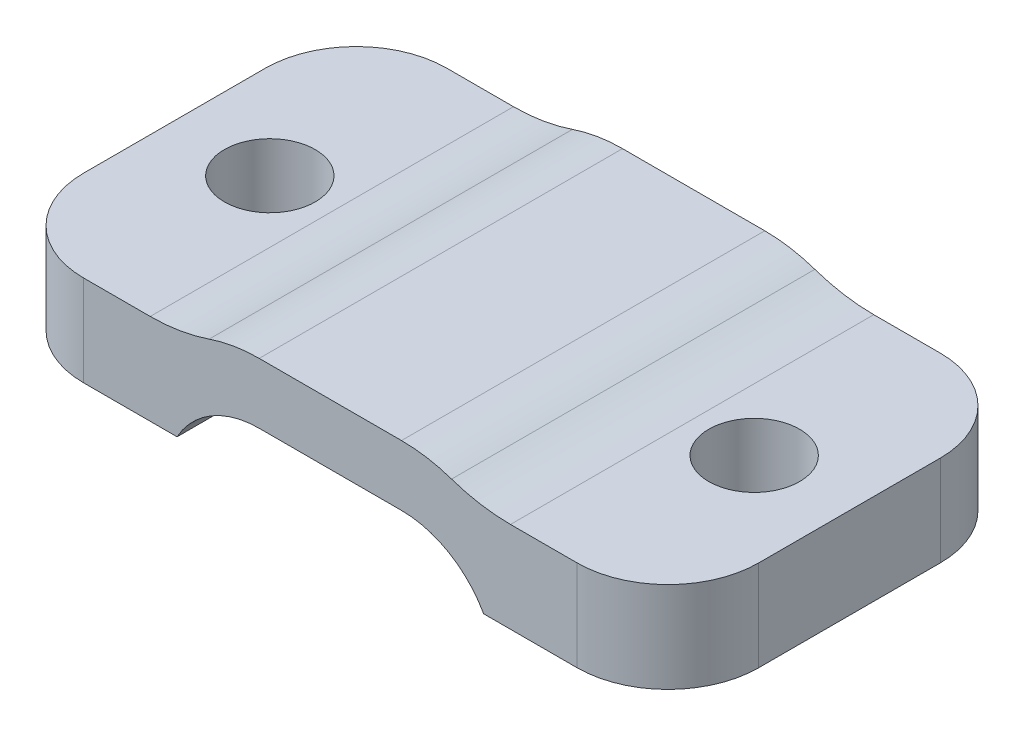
ISO-10303-21;
HEADER;
FILE_DESCRIPTION(('STEP AP214'),'2;1');
FILE_NAME('part.step','',(''),(''),'','','');
FILE_SCHEMA(('AUTOMOTIVE_DESIGN { 1 0 10303 214 1 1 1 1 }'));
ENDSEC;
DATA;
#1=APPLICATION_CONTEXT('core data for automotive mechanical design processes');
#2=APPLICATION_PROTOCOL_DEFINITION('international standard','automotive_design',2000,#1);
#3=PRODUCT_CONTEXT('',#1,'mechanical');
#4=PRODUCT('Part','Part','',(#3));
#5=PRODUCT_RELATED_PRODUCT_CATEGORY('part','',(#4));
#6=PRODUCT_DEFINITION_FORMATION('','',#4);
#7=PRODUCT_DEFINITION_CONTEXT('part definition',#1,'design');
#8=PRODUCT_DEFINITION('design','',#6,#7);
#9=PRODUCT_DEFINITION_SHAPE('','',#8);
#10=(LENGTH_UNIT() NAMED_UNIT(*) SI_UNIT(.MILLI.,.METRE.));
#11=(NAMED_UNIT(*) PLANE_ANGLE_UNIT() SI_UNIT($,.RADIAN.));
#12=(NAMED_UNIT(*) SI_UNIT($,.STERADIAN.) SOLID_ANGLE_UNIT());
#13=UNCERTAINTY_MEASURE_WITH_UNIT(LENGTH_MEASURE(1.E-05),#10,'distance_accuracy_value','');
#14=(GEOMETRIC_REPRESENTATION_CONTEXT(3) GLOBAL_UNCERTAINTY_ASSIGNED_CONTEXT((#13)) GLOBAL_UNIT_ASSIGNED_CONTEXT((#10,
#11,#12)) REPRESENTATION_CONTEXT('',''));
#15=CARTESIAN_POINT('',(0.,0.,0.));
#16=DIRECTION('',(0.,0.,1.));
#17=DIRECTION('',(1.,0.,0.));
#18=AXIS2_PLACEMENT_3D('',#15,#16,#17);
#19=CARTESIAN_POINT('',(0.,1.5,12.));
#20=DIRECTION('',(0.,1.,0.));
#21=DIRECTION('',(0.,0.,1.));
#22=AXIS2_PLACEMENT_3D('',#19,#20,#21);
#23=PLANE('',#22);
#24=CARTESIAN_POINT('',(-5.65,1.5,6.));
#25=DIRECTION('',(0.,1.,0.));
#26=DIRECTION('',(0.,0.,1.));
#27=AXIS2_PLACEMENT_3D('',#24,#25,#26);
#28=CIRCLE('',#27,1.5);
#29=CARTESIAN_POINT('',(-5.65,1.5,7.5));
#30=VERTEX_POINT('',#29);
#31=EDGE_CURVE('E274',#30,#30,#28,.T.);
#32=ORIENTED_EDGE('',*,*,#31,.T.);
#33=EDGE_LOOP('',(#32));
#34=FACE_BOUND('',#33,.T.);
#35=DIRECTION('',(0.,0.,-1.));
#36=VECTOR('',#35,1.);
#37=CARTESIAN_POINT('',(-8.8,1.5,12.));
#38=LINE('',#37,#36);
#39=CARTESIAN_POINT('',(-8.8,1.5,9.));
#40=VERTEX_POINT('',#39);
#41=CARTESIAN_POINT('',(-8.8,1.5,3.));
#42=VERTEX_POINT('',#41);
#43=EDGE_CURVE('E208',#40,#42,#38,.T.);
#44=ORIENTED_EDGE('',*,*,#43,.T.);
#45=CARTESIAN_POINT('',(-5.8,1.5,3.));
#46=DIRECTION('',(0.,1.,0.));
#47=DIRECTION('',(0.,0.,1.));
#48=AXIS2_PLACEMENT_3D('',#45,#46,#47);
#49=CIRCLE('',#48,3.);
#50=CARTESIAN_POINT('',(-5.8,1.5,0.));
#51=VERTEX_POINT('',#50);
#52=EDGE_CURVE('E283',#42,#51,#49,.F.);
#53=ORIENTED_EDGE('',*,*,#52,.T.);
#54=DIRECTION('',(1.,0.,0.));
#55=VECTOR('',#54,1.);
#56=CARTESIAN_POINT('',(0.,1.5,0.));
#57=LINE('',#56,#55);
#58=CARTESIAN_POINT('',(-2.71293199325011,1.5,0.));
#59=VERTEX_POINT('',#58);
#60=EDGE_CURVE('E177',#51,#59,#57,.T.);
#61=ORIENTED_EDGE('',*,*,#60,.T.);
#62=DIRECTION('',(0.,0.,-1.));
#63=VECTOR('',#62,1.);
#64=CARTESIAN_POINT('',(-2.71293199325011,1.5,12.));
#65=LINE('',#64,#63);
#66=CARTESIAN_POINT('',(-2.71293199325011,1.5,12.));
#67=VERTEX_POINT('',#66);
#68=EDGE_CURVE('E174',#67,#59,#65,.T.);
#69=ORIENTED_EDGE('',*,*,#68,.F.);
#70=DIRECTION('',(1.,0.,0.));
#71=VECTOR('',#70,1.);
#72=CARTESIAN_POINT('',(0.,1.5,12.));
#73=LINE('',#72,#71);
#74=CARTESIAN_POINT('',(-5.8,1.5,12.));
#75=VERTEX_POINT('',#74);
#76=EDGE_CURVE('E163',#75,#67,#73,.T.);
#77=ORIENTED_EDGE('',*,*,#76,.F.);
#78=CARTESIAN_POINT('',(-5.8,1.5,9.));
#79=DIRECTION('',(0.,1.,0.));
#80=DIRECTION('',(0.,0.,1.));
#81=AXIS2_PLACEMENT_3D('',#78,#79,#80);
#82=CIRCLE('',#81,3.);
#83=EDGE_CURVE('E281',#75,#40,#82,.F.);
#84=ORIENTED_EDGE('',*,*,#83,.T.);
#85=EDGE_LOOP('',(#44,#53,#61,#69,#77,#84));
#86=FACE_BOUND('',#85,.T.);
#87=ADVANCED_FACE('F36',(#34,#86),#23,.F.);
#88=CARTESIAN_POINT('',(0.,0.,12.));
#89=DIRECTION('',(0.,0.,-1.));
#90=DIRECTION('',(-1.,0.,0.));
#91=AXIS2_PLACEMENT_3D('',#88,#89,#90);
#92=CYLINDRICAL_SURFACE('',#91,3.1);
#93=CARTESIAN_POINT('',(0.,0.,0.));
#94=DIRECTION('',(0.,0.,1.));
#95=DIRECTION('',(1.,0.,0.));
#96=AXIS2_PLACEMENT_3D('',#93,#94,#95);
#97=CIRCLE('',#96,3.1);
#98=CARTESIAN_POINT('',(0.,3.1,0.));
#99=VERTEX_POINT('',#98);
#100=EDGE_CURVE('E210',#99,#59,#97,.T.);
#101=ORIENTED_EDGE('',*,*,#100,.F.);
#102=DIRECTION('',(0.,0.,-1.));
#103=VECTOR('',#102,1.);
#104=CARTESIAN_POINT('',(0.,3.1,12.));
#105=LINE('',#104,#103);
#106=CARTESIAN_POINT('',(0.,3.1,12.));
#107=VERTEX_POINT('',#106);
#108=EDGE_CURVE('E182',#107,#99,#105,.T.);
#109=ORIENTED_EDGE('',*,*,#108,.F.);
#110=CARTESIAN_POINT('',(0.,0.,12.));
#111=DIRECTION('',(0.,0.,1.));
#112=DIRECTION('',(1.,0.,0.));
#113=AXIS2_PLACEMENT_3D('',#110,#111,#112);
#114=CIRCLE('',#113,3.1);
#115=EDGE_CURVE('E167',#107,#67,#114,.T.);
#116=ORIENTED_EDGE('',*,*,#115,.T.);
#117=ORIENTED_EDGE('',*,*,#68,.T.);
#118=EDGE_LOOP('',(#101,#109,#116,#117));
#119=FACE_BOUND('',#118,.T.);
#120=ADVANCED_FACE('F184',(#119),#92,.F.);
#121=CARTESIAN_POINT('',(0.,3.1,12.));
#122=DIRECTION('',(0.,1.,0.));
#123=DIRECTION('',(0.,0.,1.));
#124=AXIS2_PLACEMENT_3D('',#121,#122,#123);
#125=PLANE('',#124);
#126=DIRECTION('',(1.,0.,0.));
#127=VECTOR('',#126,1.);
#128=CARTESIAN_POINT('',(0.,3.1,0.));
#129=LINE('',#128,#127);
#130=CARTESIAN_POINT('',(4.7,3.1,0.));
#131=VERTEX_POINT('',#130);
#132=EDGE_CURVE('E213',#99,#131,#129,.T.);
#133=ORIENTED_EDGE('',*,*,#132,.T.);
#134=DIRECTION('',(0.,0.,-1.));
#135=VECTOR('',#134,1.);
#136=CARTESIAN_POINT('',(4.7,3.1,12.));
#137=LINE('',#136,#135);
#138=CARTESIAN_POINT('',(4.7,3.1,12.));
#139=VERTEX_POINT('',#138);
#140=EDGE_CURVE('E249',#139,#131,#137,.T.);
#141=ORIENTED_EDGE('',*,*,#140,.F.);
#142=DIRECTION('',(1.,0.,0.));
#143=VECTOR('',#142,1.);
#144=CARTESIAN_POINT('',(0.,3.1,12.));
#145=LINE('',#144,#143);
#146=EDGE_CURVE('E186',#107,#139,#145,.T.);
#147=ORIENTED_EDGE('',*,*,#146,.F.);
#148=ORIENTED_EDGE('',*,*,#108,.T.);
#149=EDGE_LOOP('',(#133,#141,#147,#148));
#150=FACE_BOUND('',#149,.T.);
#151=ADVANCED_FACE('F333',(#150),#125,.F.);
#152=CARTESIAN_POINT('',(4.7,0.,12.));
#153=DIRECTION('',(0.,0.,-1.));
#154=DIRECTION('',(-1.,0.,0.));
#155=AXIS2_PLACEMENT_3D('',#152,#153,#154);
#156=CYLINDRICAL_SURFACE('',#155,3.1);
#157=CARTESIAN_POINT('',(4.7,0.,0.));
#158=DIRECTION('',(0.,0.,1.));
#159=DIRECTION('',(1.,0.,0.));
#160=AXIS2_PLACEMENT_3D('',#157,#158,#159);
#161=CIRCLE('',#160,3.1);
#162=CARTESIAN_POINT('',(7.41293199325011,1.5,0.));
#163=VERTEX_POINT('',#162);
#164=EDGE_CURVE('E216',#163,#131,#161,.T.);
#165=ORIENTED_EDGE('',*,*,#164,.F.);
#166=DIRECTION('',(0.,0.,-1.));
#167=VECTOR('',#166,1.);
#168=CARTESIAN_POINT('',(7.41293199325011,1.5,12.));
#169=LINE('',#168,#167);
#170=CARTESIAN_POINT('',(7.41293199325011,1.5,12.));
#171=VERTEX_POINT('',#170);
#172=EDGE_CURVE('E247',#171,#163,#169,.T.);
#173=ORIENTED_EDGE('',*,*,#172,.F.);
#174=CARTESIAN_POINT('',(4.7,0.,12.));
#175=DIRECTION('',(0.,0.,1.));
#176=DIRECTION('',(1.,0.,0.));
#177=AXIS2_PLACEMENT_3D('',#174,#175,#176);
#178=CIRCLE('',#177,3.1);
#179=EDGE_CURVE('E188',#171,#139,#178,.T.);
#180=ORIENTED_EDGE('',*,*,#179,.T.);
#181=ORIENTED_EDGE('',*,*,#140,.T.);
#182=EDGE_LOOP('',(#165,#173,#180,#181));
#183=FACE_BOUND('',#182,.T.);
#184=ADVANCED_FACE('F330',(#183),#156,.F.);
#185=CARTESIAN_POINT('',(0.,1.5,12.));
#186=DIRECTION('',(0.,1.,0.));
#187=DIRECTION('',(0.,0.,1.));
#188=AXIS2_PLACEMENT_3D('',#185,#186,#187);
#189=PLANE('',#188);
#190=CARTESIAN_POINT('',(10.35,1.5,6.));
#191=DIRECTION('',(0.,1.,0.));
#192=DIRECTION('',(0.,0.,1.));
#193=AXIS2_PLACEMENT_3D('',#190,#191,#192);
#194=CIRCLE('',#193,1.5);
#195=CARTESIAN_POINT('',(10.35,1.5,7.5));
#196=VERTEX_POINT('',#195);
#197=EDGE_CURVE('E423',#196,#196,#194,.T.);
#198=ORIENTED_EDGE('',*,*,#197,.T.);
#199=EDGE_LOOP('',(#198));
#200=FACE_BOUND('',#199,.T.);
#201=DIRECTION('',(1.,0.,0.));
#202=VECTOR('',#201,1.);
#203=CARTESIAN_POINT('',(0.,1.5,0.));
#204=LINE('',#203,#202);
#205=CARTESIAN_POINT('',(10.5,1.5,0.));
#206=VERTEX_POINT('',#205);
#207=EDGE_CURVE('E219',#163,#206,#204,.T.);
#208=ORIENTED_EDGE('',*,*,#207,.T.);
#209=CARTESIAN_POINT('',(10.5,1.5,3.));
#210=DIRECTION('',(0.,1.,0.));
#211=DIRECTION('',(0.,0.,1.));
#212=AXIS2_PLACEMENT_3D('',#209,#210,#211);
#213=CIRCLE('',#212,3.);
#214=CARTESIAN_POINT('',(13.5,1.5,3.));
#215=VERTEX_POINT('',#214);
#216=EDGE_CURVE('E296',#206,#215,#213,.F.);
#217=ORIENTED_EDGE('',*,*,#216,.T.);
#218=DIRECTION('',(0.,0.,-1.));
#219=VECTOR('',#218,1.);
#220=CARTESIAN_POINT('',(13.5,1.5,12.));
#221=LINE('',#220,#219);
#222=CARTESIAN_POINT('',(13.5,1.5,9.));
#223=VERTEX_POINT('',#222);
#224=EDGE_CURVE('E245',#223,#215,#221,.T.);
#225=ORIENTED_EDGE('',*,*,#224,.F.);
#226=CARTESIAN_POINT('',(10.5,1.5,9.));
#227=DIRECTION('',(0.,1.,0.));
#228=DIRECTION('',(0.,0.,1.));
#229=AXIS2_PLACEMENT_3D('',#226,#227,#228);
#230=CIRCLE('',#229,3.);
#231=CARTESIAN_POINT('',(10.5,1.5,12.));
#232=VERTEX_POINT('',#231);
#233=EDGE_CURVE('E294',#223,#232,#230,.F.);
#234=ORIENTED_EDGE('',*,*,#233,.T.);
#235=DIRECTION('',(1.,0.,0.));
#236=VECTOR('',#235,1.);
#237=CARTESIAN_POINT('',(0.,1.5,12.));
#238=LINE('',#237,#236);
#239=EDGE_CURVE('E194',#171,#232,#238,.T.);
#240=ORIENTED_EDGE('',*,*,#239,.F.);
#241=ORIENTED_EDGE('',*,*,#172,.T.);
#242=EDGE_LOOP('',(#208,#217,#225,#234,#240,#241));
#243=FACE_BOUND('',#242,.T.);
#244=ADVANCED_FACE('F319',(#200,#243),#189,.F.);
#245=CARTESIAN_POINT('',(13.5,0.,12.));
#246=DIRECTION('',(1.,0.,0.));
#247=DIRECTION('',(0.,0.,-1.));
#248=AXIS2_PLACEMENT_3D('',#245,#246,#247);
#249=PLANE('',#248);
#250=ORIENTED_EDGE('',*,*,#224,.T.);
#251=DIRECTION('',(0.,-1.,0.));
#252=VECTOR('',#251,1.);
#253=CARTESIAN_POINT('',(13.5,4.5,3.));
#254=LINE('',#253,#252);
#255=CARTESIAN_POINT('',(13.5,4.5,3.));
#256=VERTEX_POINT('',#255);
#257=EDGE_CURVE('E57',#215,#256,#254,.F.);
#258=ORIENTED_EDGE('',*,*,#257,.T.);
#259=DIRECTION('',(0.,0.,-1.));
#260=VECTOR('',#259,1.);
#261=CARTESIAN_POINT('',(13.5,4.5,12.));
#262=LINE('',#261,#260);
#263=CARTESIAN_POINT('',(13.5,4.5,9.));
#264=VERTEX_POINT('',#263);
#265=EDGE_CURVE('E243',#264,#256,#262,.T.);
#266=ORIENTED_EDGE('',*,*,#265,.F.);
#267=DIRECTION('',(0.,-1.,0.));
#268=VECTOR('',#267,1.);
#269=CARTESIAN_POINT('',(13.5,0.,9.));
#270=LINE('',#269,#268);
#271=EDGE_CURVE('E298',#264,#223,#270,.T.);
#272=ORIENTED_EDGE('',*,*,#271,.T.);
#273=EDGE_LOOP('',(#250,#258,#266,#272));
#274=FACE_BOUND('',#273,.T.);
#275=ADVANCED_FACE('F320',(#274),#249,.T.);
#276=CARTESIAN_POINT('',(0.,4.5,12.));
#277=DIRECTION('',(0.,1.,0.));
#278=DIRECTION('',(0.,0.,1.));
#279=AXIS2_PLACEMENT_3D('',#276,#277,#278);
#280=PLANE('',#279);
#281=CARTESIAN_POINT('',(10.35,4.5,6.));
#282=DIRECTION('',(0.,1.,0.));
#283=DIRECTION('',(0.,0.,1.));
#284=AXIS2_PLACEMENT_3D('',#281,#282,#283);
#285=CIRCLE('',#284,1.5);
#286=CARTESIAN_POINT('',(10.35,4.5,7.5));
#287=VERTEX_POINT('',#286);
#288=EDGE_CURVE('E211',#287,#287,#285,.T.);
#289=ORIENTED_EDGE('',*,*,#288,.F.);
#290=EDGE_LOOP('',(#289));
#291=FACE_BOUND('',#290,.T.);
#292=ORIENTED_EDGE('',*,*,#265,.T.);
#293=CARTESIAN_POINT('',(10.5,4.5,3.));
#294=DIRECTION('',(0.,1.,0.));
#295=DIRECTION('',(0.,0.,1.));
#296=AXIS2_PLACEMENT_3D('',#293,#294,#295);
#297=CIRCLE('',#296,3.);
#298=CARTESIAN_POINT('',(10.5,4.5,0.));
#299=VERTEX_POINT('',#298);
#300=EDGE_CURVE('E304',#256,#299,#297,.T.);
#301=ORIENTED_EDGE('',*,*,#300,.T.);
#302=DIRECTION('',(1.,0.,0.));
#303=VECTOR('',#302,1.);
#304=CARTESIAN_POINT('',(0.,4.5,0.));
#305=LINE('',#304,#303);
#306=CARTESIAN_POINT('',(8.3,4.5,0.));
#307=VERTEX_POINT('',#306);
#308=EDGE_CURVE('E222',#307,#299,#305,.T.);
#309=ORIENTED_EDGE('',*,*,#308,.F.);
#310=DIRECTION('',(0.,0.,-1.));
#311=VECTOR('',#310,1.);
#312=CARTESIAN_POINT('',(8.3,4.5,12.));
#313=LINE('',#312,#311);
#314=CARTESIAN_POINT('',(8.3,4.5,12.));
#315=VERTEX_POINT('',#314);
#316=EDGE_CURVE('E254',#307,#315,#313,.F.);
#317=ORIENTED_EDGE('',*,*,#316,.T.);
#318=DIRECTION('',(1.,0.,0.));
#319=VECTOR('',#318,1.);
#320=CARTESIAN_POINT('',(0.,4.5,12.));
#321=LINE('',#320,#319);
#322=CARTESIAN_POINT('',(10.5,4.5,12.));
#323=VERTEX_POINT('',#322);
#324=EDGE_CURVE('E196',#315,#323,#321,.T.);
#325=ORIENTED_EDGE('',*,*,#324,.T.);
#326=CARTESIAN_POINT('',(10.5,4.5,9.));
#327=DIRECTION('',(0.,1.,0.));
#328=DIRECTION('',(0.,0.,1.));
#329=AXIS2_PLACEMENT_3D('',#326,#327,#328);
#330=CIRCLE('',#329,3.);
#331=EDGE_CURVE('E302',#323,#264,#330,.T.);
#332=ORIENTED_EDGE('',*,*,#331,.T.);
#333=EDGE_LOOP('',(#292,#301,#309,#317,#325,#332));
#334=FACE_BOUND('',#333,.T.);
#335=ADVANCED_FACE('F308',(#291,#334),#280,.T.);
#336=CARTESIAN_POINT('',(4.7,0.,12.));
#337=DIRECTION('',(0.,0.,-1.));
#338=DIRECTION('',(-1.,0.,0.));
#339=AXIS2_PLACEMENT_3D('',#336,#337,#338);
#340=CYLINDRICAL_SURFACE('',#339,5.1);
#341=CARTESIAN_POINT('',(4.7,0.,12.));
#342=DIRECTION('',(0.,0.,1.));
#343=DIRECTION('',(1.,0.,0.));
#344=AXIS2_PLACEMENT_3D('',#341,#342,#343);
#345=CIRCLE('',#344,5.1);
#346=CARTESIAN_POINT('',(6.35405405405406,4.82432432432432,12.));
#347=VERTEX_POINT('',#346);
#348=CARTESIAN_POINT('',(4.7,5.1,12.));
#349=VERTEX_POINT('',#348);
#350=EDGE_CURVE('E198',#347,#349,#345,.T.);
#351=ORIENTED_EDGE('',*,*,#350,.F.);
#352=DIRECTION('',(0.,0.,-1.));
#353=VECTOR('',#352,1.);
#354=CARTESIAN_POINT('',(6.35405405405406,4.82432432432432,12.));
#355=LINE('',#354,#353);
#356=CARTESIAN_POINT('',(6.35405405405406,4.82432432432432,0.));
#357=VERTEX_POINT('',#356);
#358=EDGE_CURVE('E181',#347,#357,#355,.T.);
#359=ORIENTED_EDGE('',*,*,#358,.T.);
#360=CARTESIAN_POINT('',(4.7,0.,0.));
#361=DIRECTION('',(0.,0.,1.));
#362=DIRECTION('',(1.,0.,0.));
#363=AXIS2_PLACEMENT_3D('',#360,#361,#362);
#364=CIRCLE('',#363,5.1);
#365=CARTESIAN_POINT('',(4.7,5.1,0.));
#366=VERTEX_POINT('',#365);
#367=EDGE_CURVE('E225',#357,#366,#364,.T.);
#368=ORIENTED_EDGE('',*,*,#367,.T.);
#369=DIRECTION('',(0.,0.,-1.));
#370=VECTOR('',#369,1.);
#371=CARTESIAN_POINT('',(4.7,5.1,12.));
#372=LINE('',#371,#370);
#373=EDGE_CURVE('E240',#349,#366,#372,.T.);
#374=ORIENTED_EDGE('',*,*,#373,.F.);
#375=EDGE_LOOP('',(#351,#359,#368,#374));
#376=FACE_BOUND('',#375,.T.);
#377=ADVANCED_FACE('F407',(#376),#340,.T.);
#378=CARTESIAN_POINT('',(0.,5.1,12.));
#379=DIRECTION('',(0.,1.,0.));
#380=DIRECTION('',(0.,0.,1.));
#381=AXIS2_PLACEMENT_3D('',#378,#379,#380);
#382=PLANE('',#381);
#383=DIRECTION('',(1.,0.,0.));
#384=VECTOR('',#383,1.);
#385=CARTESIAN_POINT('',(0.,5.1,0.));
#386=LINE('',#385,#384);
#387=CARTESIAN_POINT('',(0.,5.1,0.));
#388=VERTEX_POINT('',#387);
#389=EDGE_CURVE('E227',#388,#366,#386,.T.);
#390=ORIENTED_EDGE('',*,*,#389,.F.);
#391=DIRECTION('',(0.,0.,-1.));
#392=VECTOR('',#391,1.);
#393=CARTESIAN_POINT('',(0.,5.1,12.));
#394=LINE('',#393,#392);
#395=CARTESIAN_POINT('',(0.,5.1,12.));
#396=VERTEX_POINT('',#395);
#397=EDGE_CURVE('E238',#396,#388,#394,.T.);
#398=ORIENTED_EDGE('',*,*,#397,.F.);
#399=DIRECTION('',(1.,0.,0.));
#400=VECTOR('',#399,1.);
#401=CARTESIAN_POINT('',(0.,5.1,12.));
#402=LINE('',#401,#400);
#403=EDGE_CURVE('E200',#396,#349,#402,.T.);
#404=ORIENTED_EDGE('',*,*,#403,.T.);
#405=ORIENTED_EDGE('',*,*,#373,.T.);
#406=EDGE_LOOP('',(#390,#398,#404,#405));
#407=FACE_BOUND('',#406,.T.);
#408=ADVANCED_FACE('F403',(#407),#382,.T.);
#409=CARTESIAN_POINT('',(0.,0.,12.));
#410=DIRECTION('',(0.,0.,-1.));
#411=DIRECTION('',(-1.,0.,0.));
#412=AXIS2_PLACEMENT_3D('',#409,#410,#411);
#413=CYLINDRICAL_SURFACE('',#412,5.1);
#414=CARTESIAN_POINT('',(0.,0.,0.));
#415=DIRECTION('',(0.,0.,1.));
#416=DIRECTION('',(1.,0.,0.));
#417=AXIS2_PLACEMENT_3D('',#414,#415,#416);
#418=CIRCLE('',#417,5.1);
#419=CARTESIAN_POINT('',(-1.65405405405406,4.82432432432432,0.));
#420=VERTEX_POINT('',#419);
#421=EDGE_CURVE('E230',#388,#420,#418,.T.);
#422=ORIENTED_EDGE('',*,*,#421,.T.);
#423=DIRECTION('',(0.,0.,-1.));
#424=VECTOR('',#423,1.);
#425=CARTESIAN_POINT('',(-1.65405405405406,4.82432432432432,12.));
#426=LINE('',#425,#424);
#427=CARTESIAN_POINT('',(-1.65405405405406,4.82432432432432,12.));
#428=VERTEX_POINT('',#427);
#429=EDGE_CURVE('E259',#420,#428,#426,.F.);
#430=ORIENTED_EDGE('',*,*,#429,.T.);
#431=CARTESIAN_POINT('',(0.,0.,12.));
#432=DIRECTION('',(0.,0.,1.));
#433=DIRECTION('',(1.,0.,0.));
#434=AXIS2_PLACEMENT_3D('',#431,#432,#433);
#435=CIRCLE('',#434,5.1);
#436=EDGE_CURVE('E203',#396,#428,#435,.T.);
#437=ORIENTED_EDGE('',*,*,#436,.F.);
#438=ORIENTED_EDGE('',*,*,#397,.T.);
#439=EDGE_LOOP('',(#422,#430,#437,#438));
#440=FACE_BOUND('',#439,.T.);
#441=ADVANCED_FACE('F396',(#440),#413,.T.);
#442=CARTESIAN_POINT('',(0.,4.5,12.));
#443=DIRECTION('',(0.,1.,0.));
#444=DIRECTION('',(0.,0.,1.));
#445=AXIS2_PLACEMENT_3D('',#442,#443,#444);
#446=PLANE('',#445);
#447=CARTESIAN_POINT('',(-5.65,4.5,6.));
#448=DIRECTION('',(0.,1.,0.));
#449=DIRECTION('',(0.,0.,1.));
#450=AXIS2_PLACEMENT_3D('',#447,#448,#449);
#451=CIRCLE('',#450,1.5);
#452=CARTESIAN_POINT('',(-5.65,4.5,7.5));
#453=VERTEX_POINT('',#452);
#454=EDGE_CURVE('E271',#453,#453,#451,.T.);
#455=ORIENTED_EDGE('',*,*,#454,.F.);
#456=EDGE_LOOP('',(#455));
#457=FACE_BOUND('',#456,.T.);
#458=DIRECTION('',(1.,0.,0.));
#459=VECTOR('',#458,1.);
#460=CARTESIAN_POINT('',(0.,4.5,0.));
#461=LINE('',#460,#459);
#462=CARTESIAN_POINT('',(-5.8,4.5,0.));
#463=VERTEX_POINT('',#462);
#464=CARTESIAN_POINT('',(-3.6,4.5,0.));
#465=VERTEX_POINT('',#464);
#466=EDGE_CURVE('E171',#463,#465,#461,.T.);
#467=ORIENTED_EDGE('',*,*,#466,.F.);
#468=CARTESIAN_POINT('',(-5.8,4.5,3.));
#469=DIRECTION('',(0.,1.,0.));
#470=DIRECTION('',(0.,0.,1.));
#471=AXIS2_PLACEMENT_3D('',#468,#469,#470);
#472=CIRCLE('',#471,3.);
#473=CARTESIAN_POINT('',(-8.8,4.5,3.));
#474=VERTEX_POINT('',#473);
#475=EDGE_CURVE('E292',#463,#474,#472,.T.);
#476=ORIENTED_EDGE('',*,*,#475,.T.);
#477=DIRECTION('',(0.,0.,-1.));
#478=VECTOR('',#477,1.);
#479=CARTESIAN_POINT('',(-8.8,4.5,12.));
#480=LINE('',#479,#478);
#481=CARTESIAN_POINT('',(-8.8,4.5,9.));
#482=VERTEX_POINT('',#481);
#483=EDGE_CURVE('E235',#482,#474,#480,.T.);
#484=ORIENTED_EDGE('',*,*,#483,.F.);
#485=CARTESIAN_POINT('',(-5.8,4.5,9.));
#486=DIRECTION('',(0.,1.,0.));
#487=DIRECTION('',(0.,0.,1.));
#488=AXIS2_PLACEMENT_3D('',#485,#486,#487);
#489=CIRCLE('',#488,3.);
#490=CARTESIAN_POINT('',(-5.8,4.5,12.));
#491=VERTEX_POINT('',#490);
#492=EDGE_CURVE('E290',#482,#491,#489,.T.);
#493=ORIENTED_EDGE('',*,*,#492,.T.);
#494=DIRECTION('',(1.,0.,0.));
#495=VECTOR('',#494,1.);
#496=CARTESIAN_POINT('',(0.,4.5,12.));
#497=LINE('',#496,#495);
#498=CARTESIAN_POINT('',(-3.6,4.5,12.));
#499=VERTEX_POINT('',#498);
#500=EDGE_CURVE('E206',#491,#499,#497,.T.);
#501=ORIENTED_EDGE('',*,*,#500,.T.);
#502=DIRECTION('',(0.,0.,-1.));
#503=VECTOR('',#502,1.);
#504=CARTESIAN_POINT('',(-3.6,4.5,12.));
#505=LINE('',#504,#503);
#506=EDGE_CURVE('E256',#499,#465,#505,.T.);
#507=ORIENTED_EDGE('',*,*,#506,.T.);
#508=EDGE_LOOP('',(#467,#476,#484,#493,#501,#507));
#509=FACE_BOUND('',#508,.T.);
#510=ADVANCED_FACE('F376',(#457,#509),#446,.T.);
#511=CARTESIAN_POINT('',(-8.8,0.,12.));
#512=DIRECTION('',(1.,0.,0.));
#513=DIRECTION('',(0.,0.,-1.));
#514=AXIS2_PLACEMENT_3D('',#511,#512,#513);
#515=PLANE('',#514);
#516=ORIENTED_EDGE('',*,*,#483,.T.);
#517=DIRECTION('',(0.,-1.,0.));
#518=VECTOR('',#517,1.);
#519=CARTESIAN_POINT('',(-8.8,0.,3.));
#520=LINE('',#519,#518);
#521=EDGE_CURVE('E278',#474,#42,#520,.T.);
#522=ORIENTED_EDGE('',*,*,#521,.T.);
#523=ORIENTED_EDGE('',*,*,#43,.F.);
#524=DIRECTION('',(0.,-1.,0.));
#525=VECTOR('',#524,1.);
#526=CARTESIAN_POINT('',(-8.8,4.5,9.));
#527=LINE('',#526,#525);
#528=EDGE_CURVE('E270',#40,#482,#527,.F.);
#529=ORIENTED_EDGE('',*,*,#528,.T.);
#530=EDGE_LOOP('',(#516,#522,#523,#529));
#531=FACE_BOUND('',#530,.T.);
#532=ADVANCED_FACE('F388',(#531),#515,.F.);
#533=CARTESIAN_POINT('',(0.,0.,12.));
#534=DIRECTION('',(0.,0.,1.));
#535=DIRECTION('',(1.,0.,0.));
#536=AXIS2_PLACEMENT_3D('',#533,#534,#535);
#537=PLANE('',#536);
#538=ORIENTED_EDGE('',*,*,#239,.T.);
#539=DIRECTION('',(0.,-1.,0.));
#540=VECTOR('',#539,1.);
#541=CARTESIAN_POINT('',(10.5,0.,12.));
#542=LINE('',#541,#540);
#543=EDGE_CURVE('E11',#232,#323,#542,.F.);
#544=ORIENTED_EDGE('',*,*,#543,.T.);
#545=ORIENTED_EDGE('',*,*,#324,.F.);
#546=CARTESIAN_POINT('',(8.3,10.5,12.));
#547=DIRECTION('',(0.,0.,1.));
#548=DIRECTION('',(1.,0.,0.));
#549=AXIS2_PLACEMENT_3D('',#546,#547,#548);
#550=CIRCLE('',#549,6.);
#551=EDGE_CURVE('E263',#315,#347,#550,.F.);
#552=ORIENTED_EDGE('',*,*,#551,.T.);
#553=ORIENTED_EDGE('',*,*,#350,.T.);
#554=ORIENTED_EDGE('',*,*,#403,.F.);
#555=ORIENTED_EDGE('',*,*,#436,.T.);
#556=CARTESIAN_POINT('',(-3.6,10.5,12.));
#557=DIRECTION('',(0.,0.,1.));
#558=DIRECTION('',(1.,0.,0.));
#559=AXIS2_PLACEMENT_3D('',#556,#557,#558);
#560=CIRCLE('',#559,6.);
#561=EDGE_CURVE('E267',#428,#499,#560,.F.);
#562=ORIENTED_EDGE('',*,*,#561,.T.);
#563=ORIENTED_EDGE('',*,*,#500,.F.);
#564=DIRECTION('',(0.,-1.,0.));
#565=VECTOR('',#564,1.);
#566=CARTESIAN_POINT('',(-5.8,1.5,12.));
#567=LINE('',#566,#565);
#568=EDGE_CURVE('E44',#491,#75,#567,.T.);
#569=ORIENTED_EDGE('',*,*,#568,.T.);
#570=ORIENTED_EDGE('',*,*,#76,.T.);
#571=ORIENTED_EDGE('',*,*,#115,.F.);
#572=ORIENTED_EDGE('',*,*,#146,.T.);
#573=ORIENTED_EDGE('',*,*,#179,.F.);
#574=EDGE_LOOP('',(#538,#544,#545,#552,#553,#554,#555,#562,#563,#569,#570,#571,#572,#573));
#575=FACE_BOUND('',#574,.T.);
#576=ADVANCED_FACE('F165',(#575),#537,.T.);
#577=CARTESIAN_POINT('',(0.,0.,0.));
#578=DIRECTION('',(0.,0.,1.));
#579=DIRECTION('',(1.,0.,0.));
#580=AXIS2_PLACEMENT_3D('',#577,#578,#579);
#581=PLANE('',#580);
#582=ORIENTED_EDGE('',*,*,#60,.F.);
#583=DIRECTION('',(0.,-1.,0.));
#584=VECTOR('',#583,1.);
#585=CARTESIAN_POINT('',(-5.8,0.,0.));
#586=LINE('',#585,#584);
#587=EDGE_CURVE('E288',#51,#463,#586,.F.);
#588=ORIENTED_EDGE('',*,*,#587,.T.);
#589=ORIENTED_EDGE('',*,*,#466,.T.);
#590=CARTESIAN_POINT('',(-3.6,10.5,0.));
#591=DIRECTION('',(0.,0.,1.));
#592=DIRECTION('',(1.,0.,0.));
#593=AXIS2_PLACEMENT_3D('',#590,#591,#592);
#594=CIRCLE('',#593,6.);
#595=EDGE_CURVE('E265',#465,#420,#594,.T.);
#596=ORIENTED_EDGE('',*,*,#595,.T.);
#597=ORIENTED_EDGE('',*,*,#421,.F.);
#598=ORIENTED_EDGE('',*,*,#389,.T.);
#599=ORIENTED_EDGE('',*,*,#367,.F.);
#600=CARTESIAN_POINT('',(8.3,10.5,0.));
#601=DIRECTION('',(0.,0.,1.));
#602=DIRECTION('',(1.,0.,0.));
#603=AXIS2_PLACEMENT_3D('',#600,#601,#602);
#604=CIRCLE('',#603,6.);
#605=EDGE_CURVE('E261',#357,#307,#604,.T.);
#606=ORIENTED_EDGE('',*,*,#605,.T.);
#607=ORIENTED_EDGE('',*,*,#308,.T.);
#608=DIRECTION('',(0.,-1.,0.));
#609=VECTOR('',#608,1.);
#610=CARTESIAN_POINT('',(10.5,1.5,0.));
#611=LINE('',#610,#609);
#612=EDGE_CURVE('E285',#299,#206,#611,.T.);
#613=ORIENTED_EDGE('',*,*,#612,.T.);
#614=ORIENTED_EDGE('',*,*,#207,.F.);
#615=ORIENTED_EDGE('',*,*,#164,.T.);
#616=ORIENTED_EDGE('',*,*,#132,.F.);
#617=ORIENTED_EDGE('',*,*,#100,.T.);
#618=EDGE_LOOP('',(#582,#588,#589,#596,#597,#598,#599,#606,#607,#613,#614,#615,#616,#617));
#619=FACE_BOUND('',#618,.T.);
#620=ADVANCED_FACE('F313',(#619),#581,.F.);
#621=CARTESIAN_POINT('',(8.3,10.5,12.));
#622=DIRECTION('',(0.,0.,-1.));
#623=DIRECTION('',(-1.,0.,0.));
#624=AXIS2_PLACEMENT_3D('',#621,#622,#623);
#625=CYLINDRICAL_SURFACE('',#624,6.);
#626=ORIENTED_EDGE('',*,*,#551,.F.);
#627=ORIENTED_EDGE('',*,*,#316,.F.);
#628=ORIENTED_EDGE('',*,*,#605,.F.);
#629=ORIENTED_EDGE('',*,*,#358,.F.);
#630=EDGE_LOOP('',(#626,#627,#628,#629));
#631=FACE_BOUND('',#630,.T.);
#632=ADVANCED_FACE('F349',(#631),#625,.F.);
#633=CARTESIAN_POINT('',(-3.6,10.5,12.));
#634=DIRECTION('',(0.,0.,-1.));
#635=DIRECTION('',(-1.,0.,0.));
#636=AXIS2_PLACEMENT_3D('',#633,#634,#635);
#637=CYLINDRICAL_SURFACE('',#636,6.);
#638=ORIENTED_EDGE('',*,*,#561,.F.);
#639=ORIENTED_EDGE('',*,*,#429,.F.);
#640=ORIENTED_EDGE('',*,*,#595,.F.);
#641=ORIENTED_EDGE('',*,*,#506,.F.);
#642=EDGE_LOOP('',(#638,#639,#640,#641));
#643=FACE_BOUND('',#642,.T.);
#644=ADVANCED_FACE('F352',(#643),#637,.F.);
#645=CARTESIAN_POINT('',(-5.65,1.5,6.));
#646=DIRECTION('',(0.,1.,0.));
#647=DIRECTION('',(0.,0.,1.));
#648=AXIS2_PLACEMENT_3D('',#645,#646,#647);
#649=CYLINDRICAL_SURFACE('',#648,1.5);
#650=ORIENTED_EDGE('',*,*,#454,.T.);
#651=EDGE_LOOP('',(#650));
#652=FACE_BOUND('',#651,.T.);
#653=ORIENTED_EDGE('',*,*,#31,.F.);
#654=EDGE_LOOP('',(#653));
#655=FACE_BOUND('',#654,.T.);
#656=ADVANCED_FACE('F356',(#652,#655),#649,.F.);
#657=CARTESIAN_POINT('',(10.35,1.5,6.));
#658=DIRECTION('',(0.,1.,0.));
#659=DIRECTION('',(0.,0.,1.));
#660=AXIS2_PLACEMENT_3D('',#657,#658,#659);
#661=CYLINDRICAL_SURFACE('',#660,1.5);
#662=ORIENTED_EDGE('',*,*,#288,.T.);
#663=EDGE_LOOP('',(#662));
#664=FACE_BOUND('',#663,.T.);
#665=ORIENTED_EDGE('',*,*,#197,.F.);
#666=EDGE_LOOP('',(#665));
#667=FACE_BOUND('',#666,.T.);
#668=ADVANCED_FACE('F361',(#664,#667),#661,.F.);
#669=CARTESIAN_POINT('',(-5.8,0.,3.));
#670=DIRECTION('',(0.,-1.,0.));
#671=DIRECTION('',(0.,0.,-1.));
#672=AXIS2_PLACEMENT_3D('',#669,#670,#671);
#673=CYLINDRICAL_SURFACE('',#672,3.);
#674=ORIENTED_EDGE('',*,*,#475,.F.);
#675=ORIENTED_EDGE('',*,*,#587,.F.);
#676=ORIENTED_EDGE('',*,*,#52,.F.);
#677=ORIENTED_EDGE('',*,*,#521,.F.);
#678=EDGE_LOOP('',(#674,#675,#676,#677));
#679=FACE_BOUND('',#678,.T.);
#680=ADVANCED_FACE('F358',(#679),#673,.T.);
#681=CARTESIAN_POINT('',(10.5,0.,3.));
#682=DIRECTION('',(0.,1.,0.));
#683=DIRECTION('',(0.,0.,1.));
#684=AXIS2_PLACEMENT_3D('',#681,#682,#683);
#685=CYLINDRICAL_SURFACE('',#684,3.);
#686=ORIENTED_EDGE('',*,*,#300,.F.);
#687=ORIENTED_EDGE('',*,*,#257,.F.);
#688=ORIENTED_EDGE('',*,*,#216,.F.);
#689=ORIENTED_EDGE('',*,*,#612,.F.);
#690=EDGE_LOOP('',(#686,#687,#688,#689));
#691=FACE_BOUND('',#690,.T.);
#692=ADVANCED_FACE('F316',(#691),#685,.T.);
#693=CARTESIAN_POINT('',(10.5,0.,9.));
#694=DIRECTION('',(0.,-1.,0.));
#695=DIRECTION('',(0.,0.,-1.));
#696=AXIS2_PLACEMENT_3D('',#693,#694,#695);
#697=CYLINDRICAL_SURFACE('',#696,3.);
#698=ORIENTED_EDGE('',*,*,#331,.F.);
#699=ORIENTED_EDGE('',*,*,#543,.F.);
#700=ORIENTED_EDGE('',*,*,#233,.F.);
#701=ORIENTED_EDGE('',*,*,#271,.F.);
#702=EDGE_LOOP('',(#698,#699,#700,#701));
#703=FACE_BOUND('',#702,.T.);
#704=ADVANCED_FACE('F324',(#703),#697,.T.);
#705=CARTESIAN_POINT('',(-5.8,0.,9.));
#706=DIRECTION('',(0.,1.,0.));
#707=DIRECTION('',(0.,0.,1.));
#708=AXIS2_PLACEMENT_3D('',#705,#706,#707);
#709=CYLINDRICAL_SURFACE('',#708,3.);
#710=ORIENTED_EDGE('',*,*,#492,.F.);
#711=ORIENTED_EDGE('',*,*,#528,.F.);
#712=ORIENTED_EDGE('',*,*,#83,.F.);
#713=ORIENTED_EDGE('',*,*,#568,.F.);
#714=EDGE_LOOP('',(#710,#711,#712,#713));
#715=FACE_BOUND('',#714,.T.);
#716=ADVANCED_FACE('F38',(#715),#709,.T.);
#717=CLOSED_SHELL('',(#87,#120,#151,#184,#244,#275,#335,#377,#408,#441,#510,#532,#576,#620,#632,
#644,#656,#668,#680,#692,#704,#716));
#718=MANIFOLD_SOLID_BREP('B2',#717);
#719=ADVANCED_BREP_SHAPE_REPRESENTATION('',(#18,#718),#14);
#720=SHAPE_DEFINITION_REPRESENTATION(#9,#719);
ENDSEC;
END-ISO-10303-21;
